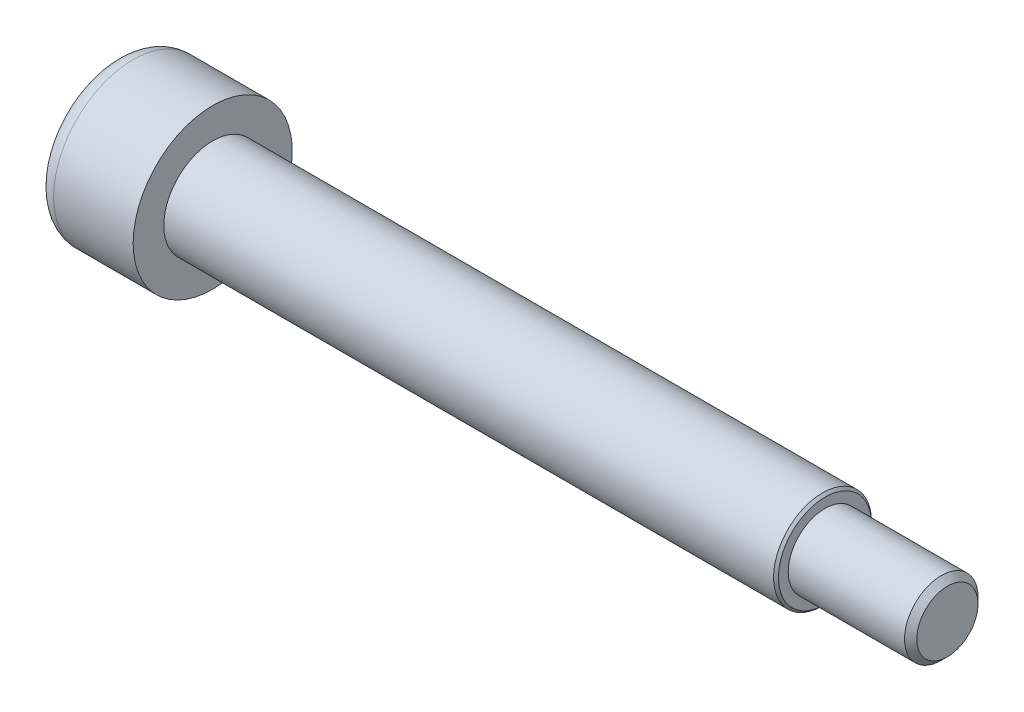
from build123d import *

# Parameters (mm, degrees)
CHANFREIN1_SIZE = 0.5
CONG_1_R        = 1.5
CHANFREIN2_SIZE = 0.2


with BuildPart() as part:
    # Esquisse1 → Base-R_volution (revolve)
    with BuildSketch(Plane.XY, mode=Mode.PRIVATE) as base_r_volution_sk:
        Polygon((60, 0), (60, -3), (50, -3), (50, -4), (0, -4), (0, -6.5), (-8, -6.5), (-8, 0), align=None)
    revolve(base_r_volution_sk.sketch.rotate(Axis((0, 0, 0), (1, 0, 0)), 270), axis=Axis((0, 0, 0), (1, 0, 0)))

    # Chanfrein1
    chanfrein1_edges = [part.edges().sort_by_distance(p)[0] for p in [
        (60, 0, -3),
    ]]
    chamfer(chanfrein1_edges, length=CHANFREIN1_SIZE)

    # Cong_1
    cong_1_edges = [part.edges().sort_by_distance(p)[0] for p in [
        (-8, 0, -6.5),
    ]]
    fillet(cong_1_edges, radius=CONG_1_R)

    # Chanfrein2
    chanfrein2_edges = [part.edges().sort_by_distance(p)[0] for p in [
        (50, 0, -4),
    ]]
    chamfer(chanfrein2_edges, length=CHANFREIN2_SIZE)


solid = part.part
